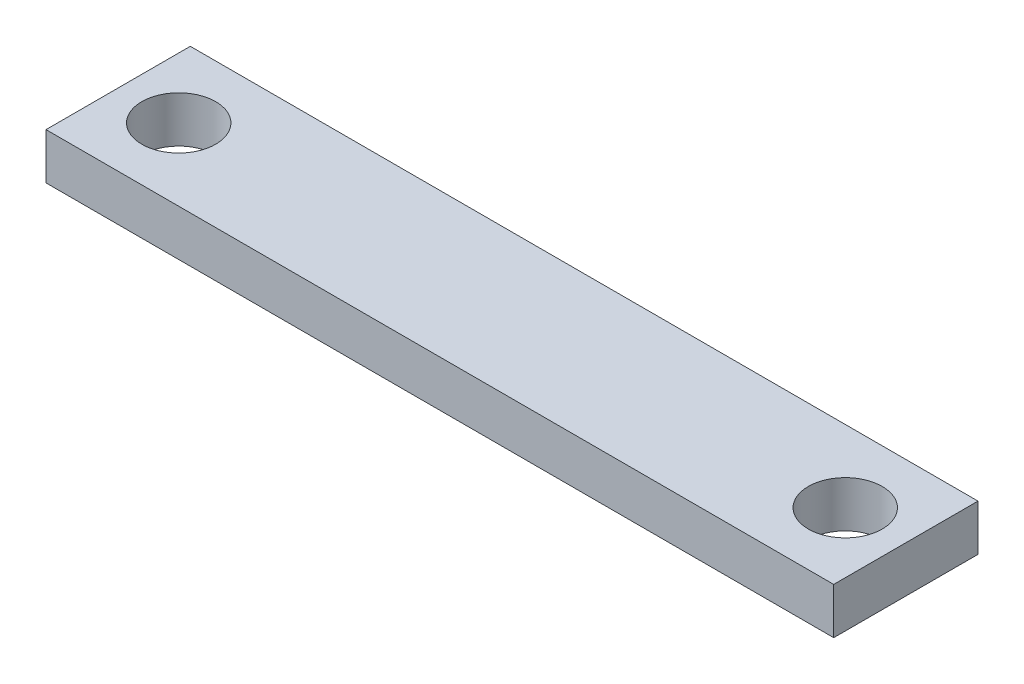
ISO-10303-21;
HEADER;
FILE_DESCRIPTION(('STEP AP214'),'2;1');
FILE_NAME('part.step','',(''),(''),'','','');
FILE_SCHEMA(('AUTOMOTIVE_DESIGN { 1 0 10303 214 1 1 1 1 }'));
ENDSEC;
DATA;
#1=APPLICATION_CONTEXT('core data for automotive mechanical design processes');
#2=APPLICATION_PROTOCOL_DEFINITION('international standard','automotive_design',2000,#1);
#3=PRODUCT_CONTEXT('',#1,'mechanical');
#4=PRODUCT('Part','Part','',(#3));
#5=PRODUCT_RELATED_PRODUCT_CATEGORY('part','',(#4));
#6=PRODUCT_DEFINITION_FORMATION('','',#4);
#7=PRODUCT_DEFINITION_CONTEXT('part definition',#1,'design');
#8=PRODUCT_DEFINITION('design','',#6,#7);
#9=PRODUCT_DEFINITION_SHAPE('','',#8);
#10=(LENGTH_UNIT() NAMED_UNIT(*) SI_UNIT(.MILLI.,.METRE.));
#11=(NAMED_UNIT(*) PLANE_ANGLE_UNIT() SI_UNIT($,.RADIAN.));
#12=(NAMED_UNIT(*) SI_UNIT($,.STERADIAN.) SOLID_ANGLE_UNIT());
#13=UNCERTAINTY_MEASURE_WITH_UNIT(LENGTH_MEASURE(1.E-05),#10,'distance_accuracy_value','');
#14=(GEOMETRIC_REPRESENTATION_CONTEXT(3) GLOBAL_UNCERTAINTY_ASSIGNED_CONTEXT((#13)) GLOBAL_UNIT_ASSIGNED_CONTEXT((#10,
#11,#12)) REPRESENTATION_CONTEXT('',''));
#15=CARTESIAN_POINT('',(0.,0.,0.));
#16=DIRECTION('',(0.,0.,1.));
#17=DIRECTION('',(1.,0.,0.));
#18=AXIS2_PLACEMENT_3D('',#15,#16,#17);
#19=CARTESIAN_POINT('',(-13.,1.524,2.38124999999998));
#20=DIRECTION('',(1.,0.,0.));
#21=DIRECTION('',(0.,0.,-1.));
#22=AXIS2_PLACEMENT_3D('',#19,#20,#21);
#23=PLANE('',#22);
#24=DIRECTION('',(0.,0.,1.));
#25=VECTOR('',#24,1.);
#26=CARTESIAN_POINT('',(-13.,0.,2.38124999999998));
#27=LINE('',#26,#25);
#28=CARTESIAN_POINT('',(-13.,0.,-2.38125000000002));
#29=VERTEX_POINT('',#28);
#30=CARTESIAN_POINT('',(-13.,0.,2.38124999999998));
#31=VERTEX_POINT('',#30);
#32=EDGE_CURVE('E98',#29,#31,#27,.T.);
#33=ORIENTED_EDGE('',*,*,#32,.T.);
#34=DIRECTION('',(0.,-1.,0.));
#35=VECTOR('',#34,1.);
#36=CARTESIAN_POINT('',(-13.,1.524,2.38124999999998));
#37=LINE('',#36,#35);
#38=CARTESIAN_POINT('',(-13.,1.524,2.38124999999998));
#39=VERTEX_POINT('',#38);
#40=EDGE_CURVE('E11',#39,#31,#37,.T.);
#41=ORIENTED_EDGE('',*,*,#40,.F.);
#42=DIRECTION('',(0.,0.,1.));
#43=VECTOR('',#42,1.);
#44=CARTESIAN_POINT('',(-13.,1.524,2.38124999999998));
#45=LINE('',#44,#43);
#46=CARTESIAN_POINT('',(-13.,1.524,-2.38125000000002));
#47=VERTEX_POINT('',#46);
#48=EDGE_CURVE('E86',#47,#39,#45,.T.);
#49=ORIENTED_EDGE('',*,*,#48,.F.);
#50=DIRECTION('',(0.,-1.,0.));
#51=VECTOR('',#50,1.);
#52=CARTESIAN_POINT('',(-13.,1.524,-2.38125000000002));
#53=LINE('',#52,#51);
#54=EDGE_CURVE('E94',#47,#29,#53,.T.);
#55=ORIENTED_EDGE('',*,*,#54,.T.);
#56=EDGE_LOOP('',(#33,#41,#49,#55));
#57=FACE_BOUND('',#56,.T.);
#58=ADVANCED_FACE('F35',(#57),#23,.F.);
#59=CARTESIAN_POINT('',(13.,1.524,2.38124999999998));
#60=DIRECTION('',(0.,0.,-1.));
#61=DIRECTION('',(-1.,0.,0.));
#62=AXIS2_PLACEMENT_3D('',#59,#60,#61);
#63=PLANE('',#62);
#64=DIRECTION('',(1.,0.,0.));
#65=VECTOR('',#64,1.);
#66=CARTESIAN_POINT('',(13.,0.,2.38124999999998));
#67=LINE('',#66,#65);
#68=CARTESIAN_POINT('',(13.,0.,2.38124999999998));
#69=VERTEX_POINT('',#68);
#70=EDGE_CURVE('E90',#31,#69,#67,.T.);
#71=ORIENTED_EDGE('',*,*,#70,.T.);
#72=DIRECTION('',(0.,-1.,0.));
#73=VECTOR('',#72,1.);
#74=CARTESIAN_POINT('',(13.,1.524,2.38124999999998));
#75=LINE('',#74,#73);
#76=CARTESIAN_POINT('',(13.,1.524,2.38124999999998));
#77=VERTEX_POINT('',#76);
#78=EDGE_CURVE('E43',#77,#69,#75,.T.);
#79=ORIENTED_EDGE('',*,*,#78,.F.);
#80=DIRECTION('',(1.,0.,0.));
#81=VECTOR('',#80,1.);
#82=CARTESIAN_POINT('',(13.,1.524,2.38124999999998));
#83=LINE('',#82,#81);
#84=EDGE_CURVE('E81',#39,#77,#83,.T.);
#85=ORIENTED_EDGE('',*,*,#84,.F.);
#86=ORIENTED_EDGE('',*,*,#40,.T.);
#87=EDGE_LOOP('',(#71,#79,#85,#86));
#88=FACE_BOUND('',#87,.T.);
#89=ADVANCED_FACE('F89',(#88),#63,.F.);
#90=CARTESIAN_POINT('',(13.,1.524,2.38124999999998));
#91=DIRECTION('',(-1.,0.,0.));
#92=DIRECTION('',(0.,0.,1.));
#93=AXIS2_PLACEMENT_3D('',#90,#91,#92);
#94=PLANE('',#93);
#95=DIRECTION('',(0.,0.,-1.));
#96=VECTOR('',#95,1.);
#97=CARTESIAN_POINT('',(13.,0.,2.38124999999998));
#98=LINE('',#97,#96);
#99=CARTESIAN_POINT('',(13.,0.,-2.38125000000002));
#100=VERTEX_POINT('',#99);
#101=EDGE_CURVE('E68',#69,#100,#98,.T.);
#102=ORIENTED_EDGE('',*,*,#101,.T.);
#103=DIRECTION('',(0.,-1.,0.));
#104=VECTOR('',#103,1.);
#105=CARTESIAN_POINT('',(13.,1.524,-2.38125000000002));
#106=LINE('',#105,#104);
#107=CARTESIAN_POINT('',(13.,1.524,-2.38125000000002));
#108=VERTEX_POINT('',#107);
#109=EDGE_CURVE('E91',#108,#100,#106,.T.);
#110=ORIENTED_EDGE('',*,*,#109,.F.);
#111=DIRECTION('',(0.,0.,-1.));
#112=VECTOR('',#111,1.);
#113=CARTESIAN_POINT('',(13.,1.524,2.38124999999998));
#114=LINE('',#113,#112);
#115=EDGE_CURVE('E84',#77,#108,#114,.T.);
#116=ORIENTED_EDGE('',*,*,#115,.F.);
#117=ORIENTED_EDGE('',*,*,#78,.T.);
#118=EDGE_LOOP('',(#102,#110,#116,#117));
#119=FACE_BOUND('',#118,.T.);
#120=ADVANCED_FACE('F92',(#119),#94,.F.);
#121=CARTESIAN_POINT('',(13.,1.524,-2.38125000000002));
#122=DIRECTION('',(0.,0.,1.));
#123=DIRECTION('',(1.,0.,0.));
#124=AXIS2_PLACEMENT_3D('',#121,#122,#123);
#125=PLANE('',#124);
#126=DIRECTION('',(-1.,0.,0.));
#127=VECTOR('',#126,1.);
#128=CARTESIAN_POINT('',(13.,0.,-2.38125000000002));
#129=LINE('',#128,#127);
#130=EDGE_CURVE('E74',#100,#29,#129,.T.);
#131=ORIENTED_EDGE('',*,*,#130,.T.);
#132=ORIENTED_EDGE('',*,*,#54,.F.);
#133=DIRECTION('',(-1.,0.,0.));
#134=VECTOR('',#133,1.);
#135=CARTESIAN_POINT('',(13.,1.524,-2.38125000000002));
#136=LINE('',#135,#134);
#137=EDGE_CURVE('E51',#108,#47,#136,.T.);
#138=ORIENTED_EDGE('',*,*,#137,.F.);
#139=ORIENTED_EDGE('',*,*,#109,.T.);
#140=EDGE_LOOP('',(#131,#132,#138,#139));
#141=FACE_BOUND('',#140,.T.);
#142=ADVANCED_FACE('F106',(#141),#125,.F.);
#143=CARTESIAN_POINT('',(0.,1.524,0.));
#144=DIRECTION('',(0.,1.,0.));
#145=DIRECTION('',(0.,0.,1.));
#146=AXIS2_PLACEMENT_3D('',#143,#144,#145);
#147=PLANE('',#146);
#148=CARTESIAN_POINT('',(-11.,1.524,0.));
#149=DIRECTION('',(0.,1.,0.));
#150=DIRECTION('',(0.,0.,1.));
#151=AXIS2_PLACEMENT_3D('',#148,#149,#150);
#152=CIRCLE('',#151,1.21919999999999);
#153=CARTESIAN_POINT('',(-11.,1.524,1.21919999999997));
#154=VERTEX_POINT('',#153);
#155=EDGE_CURVE('E120',#154,#154,#152,.T.);
#156=ORIENTED_EDGE('',*,*,#155,.F.);
#157=EDGE_LOOP('',(#156));
#158=FACE_BOUND('',#157,.T.);
#159=CARTESIAN_POINT('',(11.,1.524,0.));
#160=DIRECTION('',(0.,1.,0.));
#161=DIRECTION('',(0.,0.,1.));
#162=AXIS2_PLACEMENT_3D('',#159,#160,#161);
#163=CIRCLE('',#162,1.21919999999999);
#164=CARTESIAN_POINT('',(11.,1.524,1.21919999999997));
#165=VERTEX_POINT('',#164);
#166=EDGE_CURVE('E114',#165,#165,#163,.T.);
#167=ORIENTED_EDGE('',*,*,#166,.F.);
#168=EDGE_LOOP('',(#167));
#169=FACE_BOUND('',#168,.T.);
#170=ORIENTED_EDGE('',*,*,#48,.T.);
#171=ORIENTED_EDGE('',*,*,#84,.T.);
#172=ORIENTED_EDGE('',*,*,#115,.T.);
#173=ORIENTED_EDGE('',*,*,#137,.T.);
#174=EDGE_LOOP('',(#170,#171,#172,#173));
#175=FACE_BOUND('',#174,.T.);
#176=ADVANCED_FACE('F82',(#158,#169,#175),#147,.T.);
#177=CARTESIAN_POINT('',(0.,0.,0.));
#178=DIRECTION('',(0.,1.,0.));
#179=DIRECTION('',(0.,0.,1.));
#180=AXIS2_PLACEMENT_3D('',#177,#178,#179);
#181=PLANE('',#180);
#182=CARTESIAN_POINT('',(-11.,0.,0.));
#183=DIRECTION('',(0.,1.,0.));
#184=DIRECTION('',(0.,0.,1.));
#185=AXIS2_PLACEMENT_3D('',#182,#183,#184);
#186=CIRCLE('',#185,1.2192);
#187=CARTESIAN_POINT('',(-11.,0.,1.21919999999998));
#188=VERTEX_POINT('',#187);
#189=EDGE_CURVE('E117',#188,#188,#186,.T.);
#190=ORIENTED_EDGE('',*,*,#189,.T.);
#191=EDGE_LOOP('',(#190));
#192=FACE_BOUND('',#191,.T.);
#193=CARTESIAN_POINT('',(11.,0.,0.));
#194=DIRECTION('',(0.,1.,0.));
#195=DIRECTION('',(0.,0.,1.));
#196=AXIS2_PLACEMENT_3D('',#193,#194,#195);
#197=CIRCLE('',#196,1.2192);
#198=CARTESIAN_POINT('',(11.,0.,1.21919999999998));
#199=VERTEX_POINT('',#198);
#200=EDGE_CURVE('E101',#199,#199,#197,.T.);
#201=ORIENTED_EDGE('',*,*,#200,.T.);
#202=EDGE_LOOP('',(#201));
#203=FACE_BOUND('',#202,.T.);
#204=ORIENTED_EDGE('',*,*,#32,.F.);
#205=ORIENTED_EDGE('',*,*,#130,.F.);
#206=ORIENTED_EDGE('',*,*,#101,.F.);
#207=ORIENTED_EDGE('',*,*,#70,.F.);
#208=EDGE_LOOP('',(#204,#205,#206,#207));
#209=FACE_BOUND('',#208,.T.);
#210=ADVANCED_FACE('F109',(#192,#203,#209),#181,.F.);
#211=CARTESIAN_POINT('',(11.,1.524,0.));
#212=DIRECTION('',(0.,1.,0.));
#213=DIRECTION('',(0.,0.,1.));
#214=AXIS2_PLACEMENT_3D('',#211,#212,#213);
#215=CYLINDRICAL_SURFACE('',#214,1.21919999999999);
#216=ORIENTED_EDGE('',*,*,#200,.F.);
#217=EDGE_LOOP('',(#216));
#218=FACE_BOUND('',#217,.T.);
#219=ORIENTED_EDGE('',*,*,#166,.T.);
#220=EDGE_LOOP('',(#219));
#221=FACE_BOUND('',#220,.T.);
#222=ADVANCED_FACE('F131',(#218,#221),#215,.F.);
#223=CARTESIAN_POINT('',(-11.,1.524,0.));
#224=DIRECTION('',(0.,1.,0.));
#225=DIRECTION('',(0.,0.,1.));
#226=AXIS2_PLACEMENT_3D('',#223,#224,#225);
#227=CYLINDRICAL_SURFACE('',#226,1.21919999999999);
#228=ORIENTED_EDGE('',*,*,#189,.F.);
#229=EDGE_LOOP('',(#228));
#230=FACE_BOUND('',#229,.T.);
#231=ORIENTED_EDGE('',*,*,#155,.T.);
#232=EDGE_LOOP('',(#231));
#233=FACE_BOUND('',#232,.T.);
#234=ADVANCED_FACE('F124',(#230,#233),#227,.F.);
#235=CLOSED_SHELL('',(#58,#89,#120,#142,#176,#210,#222,#234));
#236=MANIFOLD_SOLID_BREP('B2',#235);
#237=ADVANCED_BREP_SHAPE_REPRESENTATION('',(#18,#236),#14);
#238=SHAPE_DEFINITION_REPRESENTATION(#9,#237);
ENDSEC;
END-ISO-10303-21;
